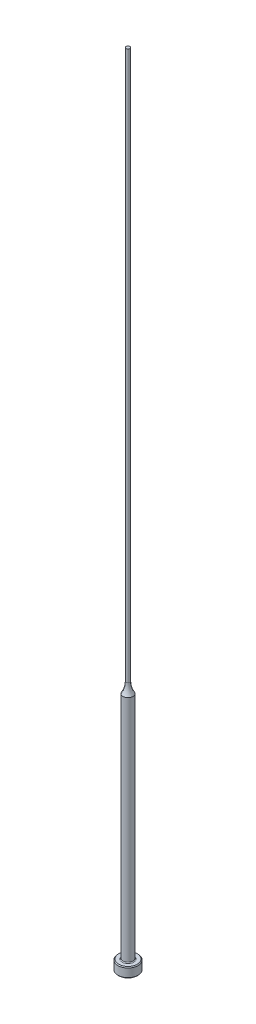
ISO-10303-21;
HEADER;
FILE_DESCRIPTION(('STEP AP214'),'2;1');
FILE_NAME('part.step','',(''),(''),'','','');
FILE_SCHEMA(('AUTOMOTIVE_DESIGN { 1 0 10303 214 1 1 1 1 }'));
ENDSEC;
DATA;
#1=APPLICATION_CONTEXT('core data for automotive mechanical design processes');
#2=APPLICATION_PROTOCOL_DEFINITION('international standard','automotive_design',2000,#1);
#3=PRODUCT_CONTEXT('',#1,'mechanical');
#4=PRODUCT('Part','Part','',(#3));
#5=PRODUCT_RELATED_PRODUCT_CATEGORY('part','',(#4));
#6=PRODUCT_DEFINITION_FORMATION('','',#4);
#7=PRODUCT_DEFINITION_CONTEXT('part definition',#1,'design');
#8=PRODUCT_DEFINITION('design','',#6,#7);
#9=PRODUCT_DEFINITION_SHAPE('','',#8);
#10=(LENGTH_UNIT() NAMED_UNIT(*) SI_UNIT(.MILLI.,.METRE.));
#11=(NAMED_UNIT(*) PLANE_ANGLE_UNIT() SI_UNIT($,.RADIAN.));
#12=(NAMED_UNIT(*) SI_UNIT($,.STERADIAN.) SOLID_ANGLE_UNIT());
#13=UNCERTAINTY_MEASURE_WITH_UNIT(LENGTH_MEASURE(1.E-05),#10,'distance_accuracy_value','');
#14=(GEOMETRIC_REPRESENTATION_CONTEXT(3) GLOBAL_UNCERTAINTY_ASSIGNED_CONTEXT((#13)) GLOBAL_UNIT_ASSIGNED_CONTEXT((#10,
#11,#12)) REPRESENTATION_CONTEXT('',''));
#15=CARTESIAN_POINT('',(0.,0.,0.));
#16=DIRECTION('',(0.,0.,1.));
#17=DIRECTION('',(1.,0.,0.));
#18=AXIS2_PLACEMENT_3D('',#15,#16,#17);
#19=CARTESIAN_POINT('',(-0.594359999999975,254.,0.));
#20=DIRECTION('',(0.,1.,0.));
#21=DIRECTION('',(0.,0.,1.));
#22=AXIS2_PLACEMENT_3D('',#19,#20,#21);
#23=PLANE('',#22);
#24=CARTESIAN_POINT('',(0.,254.,0.));
#25=DIRECTION('',(0.,1.,0.));
#26=DIRECTION('',(0.,0.,1.));
#27=AXIS2_PLACEMENT_3D('',#24,#25,#26);
#28=CIRCLE('',#27,0.594359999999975);
#29=CARTESIAN_POINT('',(0.,254.,0.594359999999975));
#30=VERTEX_POINT('',#29);
#31=EDGE_CURVE('E61',#30,#30,#28,.T.);
#32=ORIENTED_EDGE('',*,*,#31,.T.);
#33=EDGE_LOOP('',(#32));
#34=FACE_BOUND('',#33,.T.);
#35=ADVANCED_FACE('F35',(#34),#23,.T.);
#36=CARTESIAN_POINT('',(0.,259.958771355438,0.));
#37=DIRECTION('',(0.,1.,0.));
#38=DIRECTION('',(0.,0.,1.));
#39=AXIS2_PLACEMENT_3D('',#36,#37,#38);
#40=CYLINDRICAL_SURFACE('',#39,0.594359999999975);
#41=CARTESIAN_POINT('',(0.,79.6097728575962,0.));
#42=DIRECTION('',(0.,1.,0.));
#43=DIRECTION('',(0.,0.,1.));
#44=AXIS2_PLACEMENT_3D('',#41,#42,#43);
#45=CIRCLE('',#44,0.594359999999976);
#46=CARTESIAN_POINT('',(0.,79.6097728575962,0.594359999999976));
#47=VERTEX_POINT('',#46);
#48=EDGE_CURVE('E64',#47,#47,#45,.T.);
#49=ORIENTED_EDGE('',*,*,#48,.T.);
#50=EDGE_LOOP('',(#49));
#51=FACE_BOUND('',#50,.T.);
#52=ORIENTED_EDGE('',*,*,#31,.F.);
#53=EDGE_LOOP('',(#52));
#54=FACE_BOUND('',#53,.T.);
#55=ADVANCED_FACE('F84',(#51,#54),#40,.T.);
#56=CARTESIAN_POINT('',(0.,79.6097728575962,0.));
#57=DIRECTION('',(0.,1.,0.));
#58=DIRECTION('',(0.,0.,1.));
#59=AXIS2_PLACEMENT_3D('',#56,#57,#58);
#60=TOROIDAL_SURFACE('',#59,6.94435999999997,6.35);
#61=CARTESIAN_POINT('',(0.,76.2,0.));
#62=DIRECTION('',(0.,1.,0.));
#63=DIRECTION('',(0.,0.,1.));
#64=AXIS2_PLACEMENT_3D('',#61,#62,#63);
#65=CIRCLE('',#64,1.58749999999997);
#66=CARTESIAN_POINT('',(0.,76.2,1.58749999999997));
#67=VERTEX_POINT('',#66);
#68=EDGE_CURVE('E67',#67,#67,#65,.T.);
#69=ORIENTED_EDGE('',*,*,#68,.T.);
#70=EDGE_LOOP('',(#69));
#71=FACE_BOUND('',#70,.T.);
#72=ORIENTED_EDGE('',*,*,#48,.F.);
#73=EDGE_LOOP('',(#72));
#74=FACE_BOUND('',#73,.T.);
#75=ADVANCED_FACE('F71',(#71,#74),#60,.F.);
#76=CARTESIAN_POINT('',(0.,259.958771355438,0.));
#77=DIRECTION('',(0.,1.,0.));
#78=DIRECTION('',(0.,0.,1.));
#79=AXIS2_PLACEMENT_3D('',#76,#77,#78);
#80=CYLINDRICAL_SURFACE('',#79,1.58749999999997);
#81=CARTESIAN_POINT('',(0.,3.42900000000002,0.));
#82=DIRECTION('',(0.,1.,0.));
#83=DIRECTION('',(0.,0.,1.));
#84=AXIS2_PLACEMENT_3D('',#81,#82,#83);
#85=CIRCLE('',#84,1.58749999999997);
#86=CARTESIAN_POINT('',(0.,3.42900000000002,1.58749999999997));
#87=VERTEX_POINT('',#86);
#88=EDGE_CURVE('E42',#87,#87,#85,.T.);
#89=ORIENTED_EDGE('',*,*,#88,.T.);
#90=EDGE_LOOP('',(#89));
#91=FACE_BOUND('',#90,.T.);
#92=ORIENTED_EDGE('',*,*,#68,.F.);
#93=EDGE_LOOP('',(#92));
#94=FACE_BOUND('',#93,.T.);
#95=ADVANCED_FACE('F74',(#91,#94),#80,.T.);
#96=CARTESIAN_POINT('',(-3.17499999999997,3.175,0.));
#97=DIRECTION('',(0.,1.,0.));
#98=DIRECTION('',(0.,0.,1.));
#99=AXIS2_PLACEMENT_3D('',#96,#97,#98);
#100=PLANE('',#99);
#101=CARTESIAN_POINT('',(0.,3.175,0.));
#102=DIRECTION('',(0.,1.,0.));
#103=DIRECTION('',(0.,0.,1.));
#104=AXIS2_PLACEMENT_3D('',#101,#102,#103);
#105=CIRCLE('',#104,1.84149999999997);
#106=CARTESIAN_POINT('',(0.,3.175,1.84149999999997));
#107=VERTEX_POINT('',#106);
#108=EDGE_CURVE('E10',#107,#107,#105,.F.);
#109=ORIENTED_EDGE('',*,*,#108,.T.);
#110=EDGE_LOOP('',(#109));
#111=FACE_BOUND('',#110,.T.);
#112=CARTESIAN_POINT('',(0.,3.175,0.));
#113=DIRECTION('',(0.,1.,0.));
#114=DIRECTION('',(0.,0.,1.));
#115=AXIS2_PLACEMENT_3D('',#112,#113,#114);
#116=CIRCLE('',#115,2.92099999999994);
#117=CARTESIAN_POINT('',(0.,3.175,2.92099999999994));
#118=VERTEX_POINT('',#117);
#119=EDGE_CURVE('E58',#118,#118,#116,.T.);
#120=ORIENTED_EDGE('',*,*,#119,.T.);
#121=EDGE_LOOP('',(#120));
#122=FACE_BOUND('',#121,.T.);
#123=ADVANCED_FACE('F76',(#111,#122),#100,.T.);
#124=CARTESIAN_POINT('',(0.,259.958771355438,0.));
#125=DIRECTION('',(0.,1.,0.));
#126=DIRECTION('',(0.,0.,1.));
#127=AXIS2_PLACEMENT_3D('',#124,#125,#126);
#128=CYLINDRICAL_SURFACE('',#127,3.17499999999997);
#129=CARTESIAN_POINT('',(0.,2.92100000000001,0.));
#130=DIRECTION('',(0.,1.,0.));
#131=DIRECTION('',(0.,0.,1.));
#132=AXIS2_PLACEMENT_3D('',#129,#130,#131);
#133=CIRCLE('',#132,3.17499999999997);
#134=CARTESIAN_POINT('',(0.,2.92100000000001,3.17499999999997));
#135=VERTEX_POINT('',#134);
#136=EDGE_CURVE('E50',#135,#135,#133,.F.);
#137=ORIENTED_EDGE('',*,*,#136,.T.);
#138=EDGE_LOOP('',(#137));
#139=FACE_BOUND('',#138,.T.);
#140=CARTESIAN_POINT('',(0.,0.253999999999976,0.));
#141=DIRECTION('',(0.,-1.,0.));
#142=DIRECTION('',(0.,0.,-1.));
#143=AXIS2_PLACEMENT_3D('',#140,#141,#142);
#144=CIRCLE('',#143,3.17499999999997);
#145=CARTESIAN_POINT('',(0.,0.253999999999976,-3.17499999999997));
#146=VERTEX_POINT('',#145);
#147=EDGE_CURVE('E55',#146,#146,#144,.F.);
#148=ORIENTED_EDGE('',*,*,#147,.T.);
#149=EDGE_LOOP('',(#148));
#150=FACE_BOUND('',#149,.T.);
#151=ADVANCED_FACE('F82',(#139,#150),#128,.T.);
#152=CARTESIAN_POINT('',(0.,0.,0.));
#153=DIRECTION('',(0.,-1.,0.));
#154=DIRECTION('',(0.,0.,-1.));
#155=AXIS2_PLACEMENT_3D('',#152,#153,#154);
#156=PLANE('',#155);
#157=CARTESIAN_POINT('',(0.,0.,0.));
#158=DIRECTION('',(0.,-1.,0.));
#159=DIRECTION('',(0.,0.,-1.));
#160=AXIS2_PLACEMENT_3D('',#157,#158,#159);
#161=CIRCLE('',#160,2.92100000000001);
#162=CARTESIAN_POINT('',(0.,0.,-2.92100000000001));
#163=VERTEX_POINT('',#162);
#164=EDGE_CURVE('E46',#163,#163,#161,.T.);
#165=ORIENTED_EDGE('',*,*,#164,.T.);
#166=EDGE_LOOP('',(#165));
#167=FACE_BOUND('',#166,.T.);
#168=ADVANCED_FACE('F98',(#167),#156,.T.);
#169=CARTESIAN_POINT('',(0.,3.17499999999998,0.));
#170=DIRECTION('',(0.,-1.,0.));
#171=DIRECTION('',(0.,0.,-1.));
#172=AXIS2_PLACEMENT_3D('',#169,#170,#171);
#173=CONICAL_SURFACE('',#172,2.92099999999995,0.785398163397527);
#174=ORIENTED_EDGE('',*,*,#136,.F.);
#175=EDGE_LOOP('',(#174));
#176=FACE_BOUND('',#175,.T.);
#177=ORIENTED_EDGE('',*,*,#119,.F.);
#178=EDGE_LOOP('',(#177));
#179=FACE_BOUND('',#178,.T.);
#180=ADVANCED_FACE('F95',(#176,#179),#173,.T.);
#181=CARTESIAN_POINT('',(0.,0.253999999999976,0.));
#182=DIRECTION('',(0.,1.,0.));
#183=DIRECTION('',(0.,0.,1.));
#184=AXIS2_PLACEMENT_3D('',#181,#182,#183);
#185=CONICAL_SURFACE('',#184,3.17499999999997,0.785398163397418);
#186=ORIENTED_EDGE('',*,*,#164,.F.);
#187=EDGE_LOOP('',(#186));
#188=FACE_BOUND('',#187,.T.);
#189=ORIENTED_EDGE('',*,*,#147,.F.);
#190=EDGE_LOOP('',(#189));
#191=FACE_BOUND('',#190,.T.);
#192=ADVANCED_FACE('F97',(#188,#191),#185,.T.);
#193=CARTESIAN_POINT('',(0.,3.42900000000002,0.));
#194=DIRECTION('',(0.,1.,0.));
#195=DIRECTION('',(0.,0.,1.));
#196=AXIS2_PLACEMENT_3D('',#193,#194,#195);
#197=TOROIDAL_SURFACE('',#196,1.84149999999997,0.254);
#198=ORIENTED_EDGE('',*,*,#108,.F.);
#199=EDGE_LOOP('',(#198));
#200=FACE_BOUND('',#199,.T.);
#201=ORIENTED_EDGE('',*,*,#88,.F.);
#202=EDGE_LOOP('',(#201));
#203=FACE_BOUND('',#202,.T.);
#204=ADVANCED_FACE('F37',(#200,#203),#197,.F.);
#205=CLOSED_SHELL('',(#35,#55,#75,#95,#123,#151,#168,#180,#192,#204));
#206=MANIFOLD_SOLID_BREP('B2',#205);
#207=ADVANCED_BREP_SHAPE_REPRESENTATION('',(#18,#206),#14);
#208=SHAPE_DEFINITION_REPRESENTATION(#9,#207);
ENDSEC;
END-ISO-10303-21;
